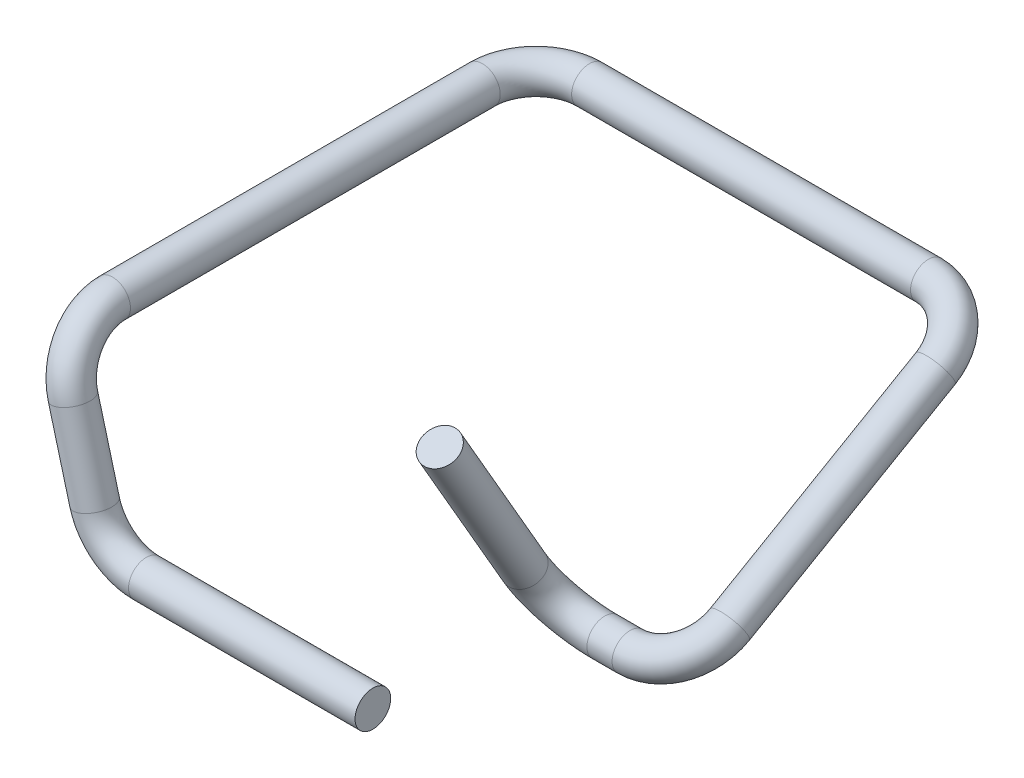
from build123d import *

# Parameters (mm, degrees)
SKETCH1_R = 10


with BuildPart() as part:
    # Base-Sweep: sweep along a curve in space
    with BuildLine() as base_sweep_path:
        Line((0, 0, 0), (-126.980190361, 0, 0))
        ThreePointArc((-126.980190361, 0, 0), (-145.243033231, 6.199399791, 0), (-155.957965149, 22.235428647, 0))
        Line((-155.957965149, 22.235428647, 0), (-168.117333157, 67.61480784, 0))
        ThreePointArc((-168.117333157, 67.61480784, 0), (-173.607714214, 88.105188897, -8.786796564), (-175.88190451, 96.592582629, -30))
        Line((-175.88190451, 96.592582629, -30), (-175.88190451, 96.592582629, -237.303260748))
        ThreePointArc((-175.88190451, 96.592582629, -237.303260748), (-167.095107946, 96.592582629, -258.516464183), (-145.88190451, 96.592582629, -267.303260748))
        Line((-145.88190451, 96.592582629, -267.303260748), (44.11809549, 96.592582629, -267.303260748))
        ThreePointArc((44.11809549, 96.592582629, -267.303260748), (65.331298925, 92.199184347, -259.693671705), (74.11809549, 81.592582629, -241.322498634))
        Line((74.11809549, 81.592582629, -241.322498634), (74.11809549, 15, -125.980762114))
        ThreePointArc((74.11809549, 15, -125.980762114), (65.331298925, 4.393398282, -107.609589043), (44.11809549, 0, -100))
        Line((44.11809549, 0, -100), (30, 0, -100))
        ThreePointArc((30, 0, -100), (8.786796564, 7.609589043, -95.606601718), (0, 25.980762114, -85))
        Line((0, 25.980762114, -85), (0, 108.253175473, -37.5))
    # Sketch1 → Base-Sweep (sweep)
    with BuildSketch(Plane(origin=(0, 0, 0), x_dir=(0, 0, -1), z_dir=(1, 0, 0))):
        Circle(SKETCH1_R)
    sweep(path=base_sweep_path.line)


solid = part.part
